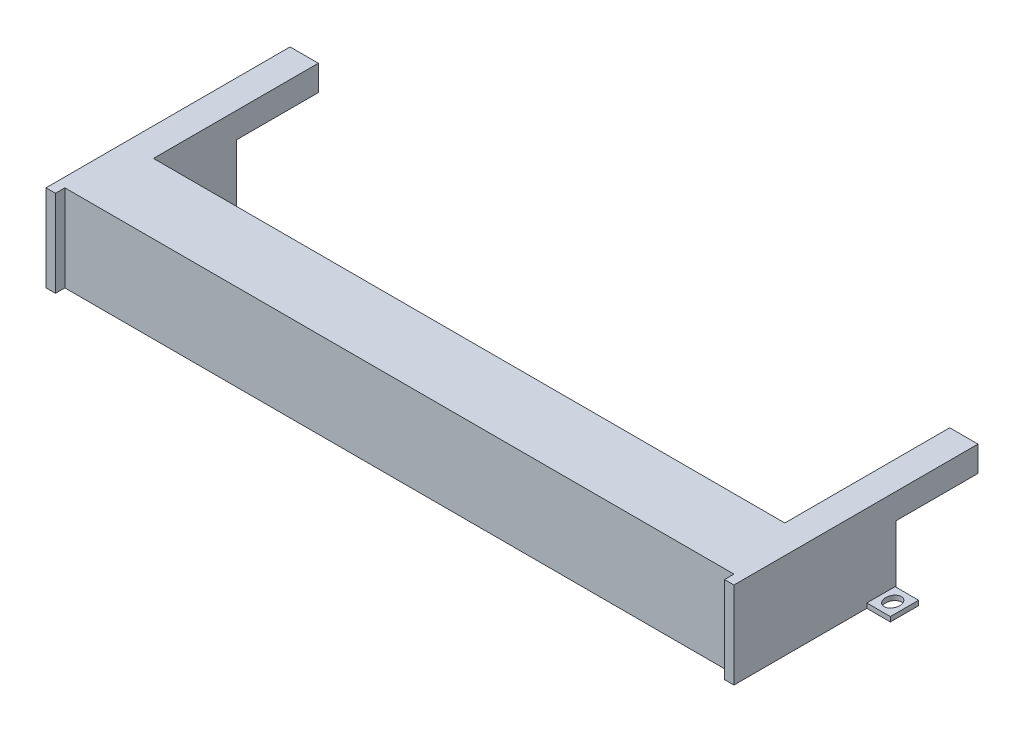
from build123d import *

# Parameters (mm, degrees)
SKETCH1_W           = 73
SKETCH1_H           = 25.9
BOSS_EXTRUDE1_DEPTH = 9.2
CUT_EXTRUDE1_REACH  = 76.708
SKETCH2_W           = 8.7
SKETCH2_H           = 6.5
CUT_EXTRUDE2_REACH  = 41.807
SKETCH3_W           = 71
SKETCH3_H           = 4.96677116
SKETCH5_W           = 2.5
SKETCH5_H           = 3
SKETCH5_RX          = 0.924731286
SKETCH5_RY          = 0.742484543
BOSS_EXTRUDE2_DEPTH = 0.5
SKETCH6_W           = 67
SKETCH6_H           = 17.5
CUT_EXTRUDE3_DEPTH  = 43.111073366


with BuildPart() as part:
    # Sketch1 → Boss-Extrude1 (new body)
    with BuildSketch(Plane(origin=(0, 0, 0), x_dir=(1, 0, 0), z_dir=(0, 1, 0))):
        Rectangle(SKETCH1_W, SKETCH1_H)
    extrude(amount=BOSS_EXTRUDE1_DEPTH)

    # Sketch2 → Cut-Extrude1 (cut, up to next)
    with BuildSketch(Plane(origin=(36.5, 0, 0), x_dir=(0, 0, -1), z_dir=(1, 0, 0)), mode=Mode.PRIVATE) as cut_extrude1_sk1:
        with Locations((8.6, 3.25)):
            Rectangle(SKETCH2_W, SKETCH2_H)
    cut_extrude1_tool1 = extrude(cut_extrude1_sk1.sketch, amount=-CUT_EXTRUDE1_REACH, mode=Mode.PRIVATE) & part.part
    add(cut_extrude1_tool1.solids().sort_by_distance((36.5, 3.25, -8.6))[0], mode=Mode.SUBTRACT)

    # Sketch3 → Cut-Extrude2 (cut, up to next)
    with BuildSketch(Plane(origin=(0, 9.2, 0), x_dir=(1, 0, 0), z_dir=(0, 1, 0)), mode=Mode.PRIVATE) as cut_extrude2_sk1:
        with Locations((0, -14.43338558)):
            Rectangle(SKETCH3_W, SKETCH3_H)
    cut_extrude2_tool1 = extrude(cut_extrude2_sk1.sketch, amount=-CUT_EXTRUDE2_REACH, mode=Mode.PRIVATE) & part.part
    add(cut_extrude2_tool1.solids().sort_by_distance((0, 9.2, 14.433386))[0], mode=Mode.SUBTRACT)

    # Sketch5 → Boss-Extrude2 (add)
    with BuildSketch(Plane.XZ):
        with Locations((37.75, -2.65)):
            Rectangle(SKETCH5_W, SKETCH5_H)
        with Locations(Location((37.75, -2.65), (0, 0, -90))):
            Ellipse(SKETCH5_RX, SKETCH5_RY, mode=Mode.SUBTRACT)
    boss_extrude2 = extrude(amount=-BOSS_EXTRUDE2_DEPTH)

    # Sketch6 → Cut-Extrude3 (cut, through all)
    with BuildSketch(Plane(origin=(0, 9.2, 0), x_dir=(1, 0, 0), z_dir=(0, 1, 0))):
        with Locations((0, 4.2)):
            Rectangle(SKETCH6_W, SKETCH6_H)
    extrude(amount=-CUT_EXTRUDE3_DEPTH, mode=Mode.SUBTRACT)

    # Mirror1: Boss-Extrude2 across plane
    add(boss_extrude2.mirror(Plane(origin=(0, 0, 0), x_dir=(0, 0, 1), z_dir=(1, 0, 0))))


solid = part.part
